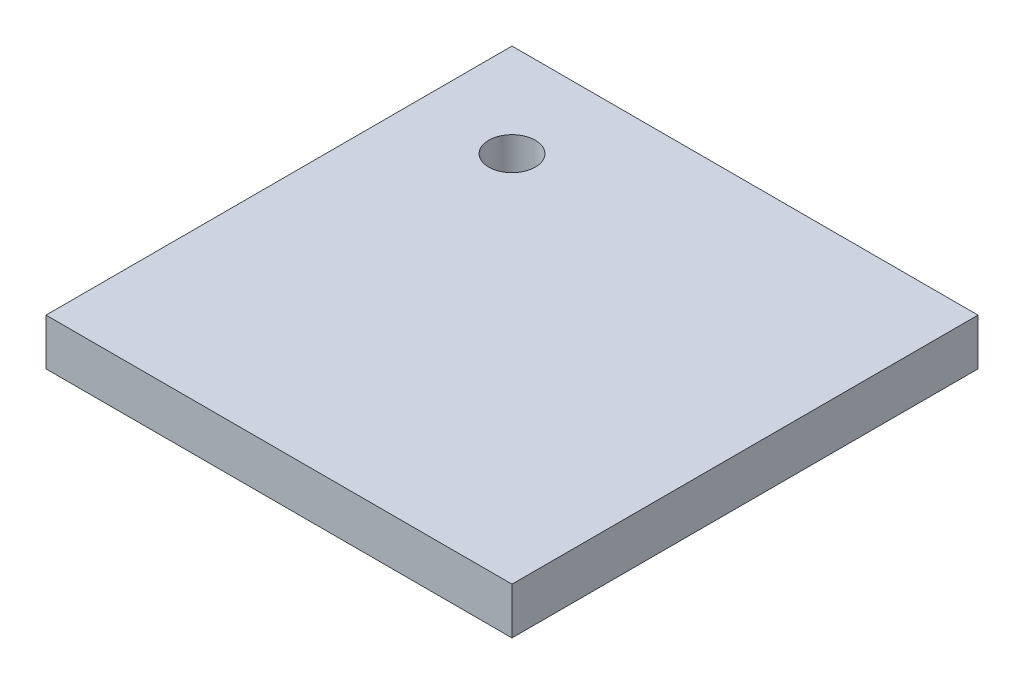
from build123d import *

# Parameters (mm, degrees)
SKETCH1_W                 = 100
SKETCH1_H                 = 100
EXTRUDE1_DEPTH            = 10
F_10_DIAMETER_HOLE1_D     = 10
F_10_DIAMETER_HOLE1_DEPTH = 10
F_10_DIAMETER_HOLE1_TIP   = 3.004303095


with BuildPart() as part:
    # Sketch1 → Extrude1 (new body)
    with BuildSketch(Plane(origin=(0, 0, 0), x_dir=(1, 0, 0), z_dir=(0, 1, 0))):
        with Locations((50, 50)):
            Rectangle(SKETCH1_W, SKETCH1_H)
    extrude(amount=EXTRUDE1_DEPTH)

    # 10_ Diameter Hole1
    with Locations(Plane(origin=(20, 10, -80), x_dir=(0, 0, 1), z_dir=(0, 1, 0))):
        with Locations((0, 0)):
            Hole(F_10_DIAMETER_HOLE1_D / 2, depth=F_10_DIAMETER_HOLE1_DEPTH)
            with Locations((0, 0, -(F_10_DIAMETER_HOLE1_DEPTH + F_10_DIAMETER_HOLE1_TIP / 2))):  # 118° drill point
                Cone(0, F_10_DIAMETER_HOLE1_D / 2, F_10_DIAMETER_HOLE1_TIP, mode=Mode.SUBTRACT)


solid = part.part
